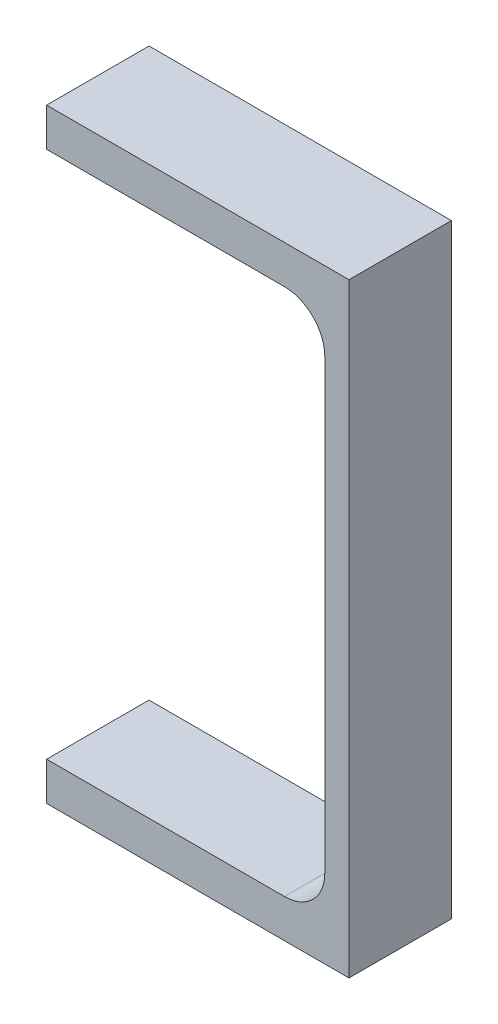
from build123d import *

# Parameters (mm, degrees)
BASESECTION_DEPTH = 12.7


with BuildPart() as part:
    # Sketch1 → BaseSection (new, symmetric)
    with BuildSketch(Plane.XY):
        with BuildLine():
            Line((-75, 75), (0, 75))
            Line((0, 75), (0, -75))
            Line((0, -75), (-75, -75))
            Line((-75, -75), (-75, -65.5))
            Line((-75, -65.5), (-16, -65.5))
            ThreePointArc((-16, -65.5), (-8.928932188, -62.571067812), (-6, -55.5))
            Line((-6, -55.5), (-6, 55.5))
            ThreePointArc((-6, 55.5), (-8.928932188, 62.571067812), (-16, 65.5))
            Line((-16, 65.5), (-75, 65.5))
            Line((-75, 65.5), (-75, 75))
        make_face()
    extrude(amount=BASESECTION_DEPTH, both=True)


solid = part.part
